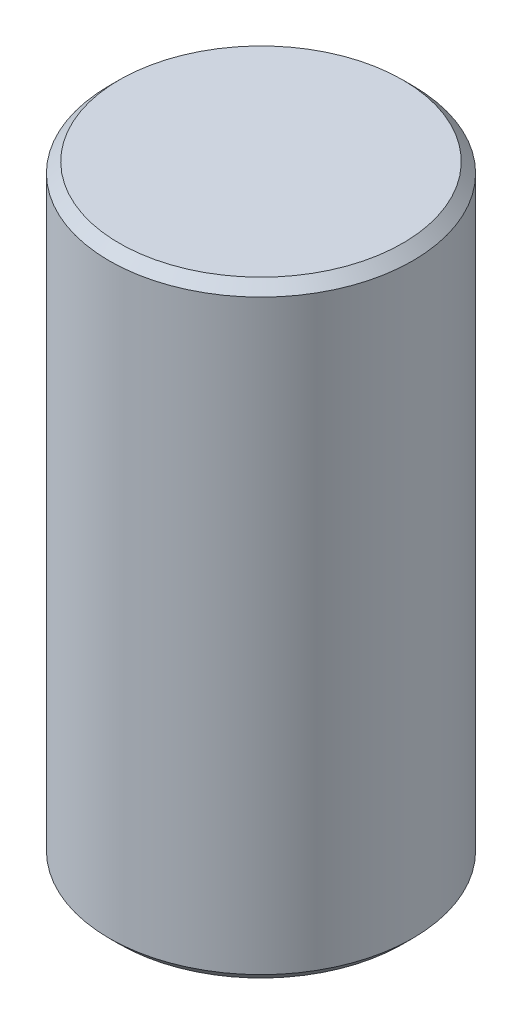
ISO-10303-21;
HEADER;
FILE_DESCRIPTION(('STEP AP214'),'2;1');
FILE_NAME('part.step','',(''),(''),'','','');
FILE_SCHEMA(('AUTOMOTIVE_DESIGN { 1 0 10303 214 1 1 1 1 }'));
ENDSEC;
DATA;
#1=APPLICATION_CONTEXT('core data for automotive mechanical design processes');
#2=APPLICATION_PROTOCOL_DEFINITION('international standard','automotive_design',2000,#1);
#3=PRODUCT_CONTEXT('',#1,'mechanical');
#4=PRODUCT('Part','Part','',(#3));
#5=PRODUCT_RELATED_PRODUCT_CATEGORY('part','',(#4));
#6=PRODUCT_DEFINITION_FORMATION('','',#4);
#7=PRODUCT_DEFINITION_CONTEXT('part definition',#1,'design');
#8=PRODUCT_DEFINITION('design','',#6,#7);
#9=PRODUCT_DEFINITION_SHAPE('','',#8);
#10=(LENGTH_UNIT() NAMED_UNIT(*) SI_UNIT(.MILLI.,.METRE.));
#11=(NAMED_UNIT(*) PLANE_ANGLE_UNIT() SI_UNIT($,.RADIAN.));
#12=(NAMED_UNIT(*) SI_UNIT($,.STERADIAN.) SOLID_ANGLE_UNIT());
#13=UNCERTAINTY_MEASURE_WITH_UNIT(LENGTH_MEASURE(1.E-05),#10,'distance_accuracy_value','');
#14=(GEOMETRIC_REPRESENTATION_CONTEXT(3) GLOBAL_UNCERTAINTY_ASSIGNED_CONTEXT((#13)) GLOBAL_UNIT_ASSIGNED_CONTEXT((#10,
#11,#12)) REPRESENTATION_CONTEXT('',''));
#15=CARTESIAN_POINT('',(0.,0.,0.));
#16=DIRECTION('',(0.,0.,1.));
#17=DIRECTION('',(1.,0.,0.));
#18=AXIS2_PLACEMENT_3D('',#15,#16,#17);
#19=CARTESIAN_POINT('',(0.,9.99999999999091,0.));
#20=DIRECTION('',(0.,-1.,0.));
#21=DIRECTION('',(0.,0.,-1.));
#22=AXIS2_PLACEMENT_3D('',#19,#20,#21);
#23=CONICAL_SURFACE('',#22,2.09999999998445,1.02974425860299);
#24=CARTESIAN_POINT('',(0.,11.2618073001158,0.));
#25=VERTEX_POINT('',#24);
#26=VERTEX_LOOP('',#25);
#27=FACE_BOUND('',#26,.T.);
#28=CARTESIAN_POINT('',(0.,10.,0.));
#29=DIRECTION('',(0.,-1.,0.));
#30=DIRECTION('',(1.,0.,0.));
#31=AXIS2_PLACEMENT_3D('',#28,#29,#30);
#32=CIRCLE('',#31,2.1);
#33=CARTESIAN_POINT('',(2.1,10.,0.));
#34=VERTEX_POINT('',#33);
#35=EDGE_CURVE('E32',#34,#34,#32,.T.);
#36=ORIENTED_EDGE('',*,*,#35,.T.);
#37=EDGE_LOOP('',(#36));
#38=FACE_BOUND('',#37,.T.);
#39=ADVANCED_FACE('F16',(#27,#38),#23,.F.);
#40=CARTESIAN_POINT('',(0.,11.82489766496,0.));
#41=DIRECTION('',(0.,-1.,0.));
#42=DIRECTION('',(1.,0.,0.));
#43=AXIS2_PLACEMENT_3D('',#40,#41,#42);
#44=CYLINDRICAL_SURFACE('',#43,2.1);
#45=ORIENTED_EDGE('',*,*,#35,.F.);
#46=EDGE_LOOP('',(#45));
#47=FACE_BOUND('',#46,.T.);
#48=CARTESIAN_POINT('',(0.,0.,0.));
#49=DIRECTION('',(0.,-1.,0.));
#50=DIRECTION('',(1.,0.,0.));
#51=AXIS2_PLACEMENT_3D('',#48,#49,#50);
#52=CIRCLE('',#51,2.1);
#53=CARTESIAN_POINT('',(2.1,0.,0.));
#54=VERTEX_POINT('',#53);
#55=EDGE_CURVE('E19',#54,#54,#52,.T.);
#56=ORIENTED_EDGE('',*,*,#55,.T.);
#57=EDGE_LOOP('',(#56));
#58=FACE_BOUND('',#57,.T.);
#59=ADVANCED_FACE('F29',(#47,#58),#44,.F.);
#60=CARTESIAN_POINT('',(0.,0.,0.));
#61=DIRECTION('',(0.,1.,0.));
#62=DIRECTION('',(-1.,0.,0.));
#63=AXIS2_PLACEMENT_3D('',#60,#61,#62);
#64=PLANE('',#63);
#65=CARTESIAN_POINT('',(0.,0.,0.));
#66=DIRECTION('',(0.,1.,0.));
#67=DIRECTION('',(0.,0.,1.));
#68=AXIS2_PLACEMENT_3D('',#65,#66,#67);
#69=CIRCLE('',#68,7.00000000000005);
#70=CARTESIAN_POINT('',(0.,0.,7.00000000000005));
#71=VERTEX_POINT('',#70);
#72=EDGE_CURVE('E36',#71,#71,#69,.T.);
#73=ORIENTED_EDGE('',*,*,#72,.F.);
#74=EDGE_LOOP('',(#73));
#75=FACE_BOUND('',#74,.T.);
#76=ORIENTED_EDGE('',*,*,#55,.F.);
#77=EDGE_LOOP('',(#76));
#78=FACE_BOUND('',#77,.T.);
#79=ADVANCED_FACE('F46',(#75,#78),#64,.F.);
#80=CARTESIAN_POINT('',(0.,30.,0.));
#81=DIRECTION('',(0.,1.,0.));
#82=DIRECTION('',(-1.,0.,0.));
#83=AXIS2_PLACEMENT_3D('',#80,#81,#82);
#84=PLANE('',#83);
#85=CARTESIAN_POINT('',(0.,30.,0.));
#86=DIRECTION('',(0.,-1.,0.));
#87=DIRECTION('',(0.,0.,-1.));
#88=AXIS2_PLACEMENT_3D('',#85,#86,#87);
#89=CIRCLE('',#88,7.00000000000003);
#90=CARTESIAN_POINT('',(0.,30.,-7.00000000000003));
#91=VERTEX_POINT('',#90);
#92=EDGE_CURVE('E39',#91,#91,#89,.T.);
#93=ORIENTED_EDGE('',*,*,#92,.F.);
#94=EDGE_LOOP('',(#93));
#95=FACE_BOUND('',#94,.T.);
#96=ADVANCED_FACE('F49',(#95),#84,.T.);
#97=CARTESIAN_POINT('',(0.,0.500000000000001,0.));
#98=DIRECTION('',(0.,1.,0.));
#99=DIRECTION('',(0.,0.,1.));
#100=AXIS2_PLACEMENT_3D('',#97,#98,#99);
#101=CONICAL_SURFACE('',#100,7.49999999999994,0.7853981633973);
#102=CARTESIAN_POINT('',(0.,0.5,0.));
#103=DIRECTION('',(0.,1.,0.));
#104=DIRECTION('',(-1.,0.,0.));
#105=AXIS2_PLACEMENT_3D('',#102,#103,#104);
#106=CIRCLE('',#105,7.5);
#107=CARTESIAN_POINT('',(-7.5,0.5,0.));
#108=VERTEX_POINT('',#107);
#109=EDGE_CURVE('E23',#108,#108,#106,.T.);
#110=ORIENTED_EDGE('',*,*,#109,.F.);
#111=EDGE_LOOP('',(#110));
#112=FACE_BOUND('',#111,.T.);
#113=ORIENTED_EDGE('',*,*,#72,.T.);
#114=EDGE_LOOP('',(#113));
#115=FACE_BOUND('',#114,.T.);
#116=ADVANCED_FACE('F44',(#112,#115),#101,.T.);
#117=CARTESIAN_POINT('',(0.,29.5,0.));
#118=DIRECTION('',(0.,-1.,0.));
#119=DIRECTION('',(0.,0.,-1.));
#120=AXIS2_PLACEMENT_3D('',#117,#118,#119);
#121=CONICAL_SURFACE('',#120,7.49999999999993,0.785398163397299);
#122=CARTESIAN_POINT('',(0.,29.5,0.));
#123=DIRECTION('',(0.,1.,0.));
#124=DIRECTION('',(-1.,0.,0.));
#125=AXIS2_PLACEMENT_3D('',#122,#123,#124);
#126=CIRCLE('',#125,7.5);
#127=CARTESIAN_POINT('',(-7.5,29.5,0.));
#128=VERTEX_POINT('',#127);
#129=EDGE_CURVE('E11',#128,#128,#126,.F.);
#130=ORIENTED_EDGE('',*,*,#129,.F.);
#131=EDGE_LOOP('',(#130));
#132=FACE_BOUND('',#131,.T.);
#133=ORIENTED_EDGE('',*,*,#92,.T.);
#134=EDGE_LOOP('',(#133));
#135=FACE_BOUND('',#134,.T.);
#136=ADVANCED_FACE('F59',(#132,#135),#121,.T.);
#137=CARTESIAN_POINT('',(0.,0.,0.));
#138=DIRECTION('',(0.,1.,0.));
#139=DIRECTION('',(-1.,0.,0.));
#140=AXIS2_PLACEMENT_3D('',#137,#138,#139);
#141=CYLINDRICAL_SURFACE('',#140,7.5);
#142=ORIENTED_EDGE('',*,*,#129,.T.);
#143=EDGE_LOOP('',(#142));
#144=FACE_BOUND('',#143,.T.);
#145=ORIENTED_EDGE('',*,*,#109,.T.);
#146=EDGE_LOOP('',(#145));
#147=FACE_BOUND('',#146,.T.);
#148=ADVANCED_FACE('F57',(#144,#147),#141,.T.);
#149=CLOSED_SHELL('',(#39,#59,#79,#96,#116,#136,#148));
#150=MANIFOLD_SOLID_BREP('B1',#149);
#151=ADVANCED_BREP_SHAPE_REPRESENTATION('',(#18,#150),#14);
#152=SHAPE_DEFINITION_REPRESENTATION(#9,#151);
ENDSEC;
END-ISO-10303-21;
